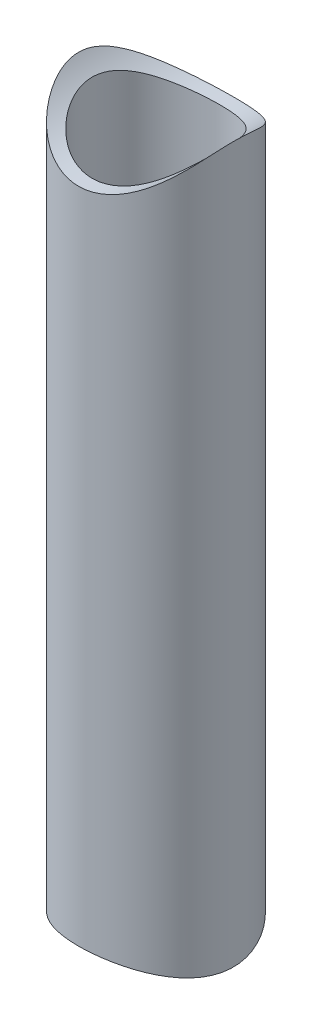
from build123d import *

# Parameters (mm, degrees)
SKETCH1_R           = 12.7
SKETCH1_R_2         = 10.4648
BOSS_EXTRUDE1_DEPTH = 152.4
SKETCH2_R           = 15.875
CUT_EXTRUDE1_DEPTH  = 76.2
SKETCH3_R           = 28.575
CUT_EXTRUDE2_DEPTH  = 25.4


with BuildPart() as part:
    # Sketch1 → Boss-Extrude1 (new body)
    with BuildSketch(Plane(origin=(0, 0, 0), x_dir=(1, 0, 0), z_dir=(0, 1, 0))):
        with Locations(Location((0, 0, 0), (0, 0, 270))):
            Circle(SKETCH1_R)
        with Locations(Location((0, 0, 0), (0, 0, 270))):
            Circle(SKETCH1_R_2, mode=Mode.SUBTRACT)
    extrude(amount=-BOSS_EXTRUDE1_DEPTH)

    # Sketch2 → Cut-Extrude1 (cut, symmetric)
    with BuildSketch(Plane.XY):
        Circle(SKETCH2_R)
    extrude(amount=CUT_EXTRUDE1_DEPTH, both=True, mode=Mode.SUBTRACT)

    # Sketch3 → Cut-Extrude2 (cut, symmetric)
    with BuildSketch(Plane.XY):
        with Locations((0, -152.4)):
            Circle(SKETCH3_R)
    extrude(amount=CUT_EXTRUDE2_DEPTH, both=True, mode=Mode.SUBTRACT)


solid = part.part
